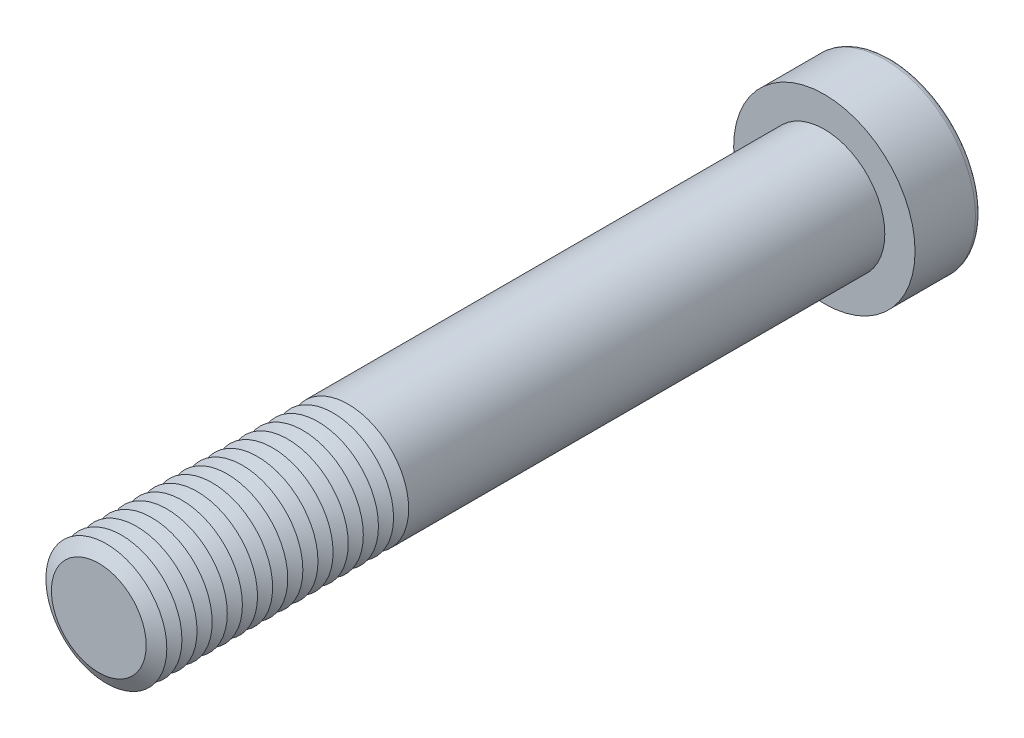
ISO-10303-21;
HEADER;
FILE_DESCRIPTION(('STEP AP214'),'2;1');
FILE_NAME('part.step','',(''),(''),'','','');
FILE_SCHEMA(('AUTOMOTIVE_DESIGN { 1 0 10303 214 1 1 1 1 }'));
ENDSEC;
DATA;
#1=APPLICATION_CONTEXT('core data for automotive mechanical design processes');
#2=APPLICATION_PROTOCOL_DEFINITION('international standard','automotive_design',2000,#1);
#3=PRODUCT_CONTEXT('',#1,'mechanical');
#4=PRODUCT('Part','Part','',(#3));
#5=PRODUCT_RELATED_PRODUCT_CATEGORY('part','',(#4));
#6=PRODUCT_DEFINITION_FORMATION('','',#4);
#7=PRODUCT_DEFINITION_CONTEXT('part definition',#1,'design');
#8=PRODUCT_DEFINITION('design','',#6,#7);
#9=PRODUCT_DEFINITION_SHAPE('','',#8);
#10=(LENGTH_UNIT() NAMED_UNIT(*) SI_UNIT(.MILLI.,.METRE.));
#11=(NAMED_UNIT(*) PLANE_ANGLE_UNIT() SI_UNIT($,.RADIAN.));
#12=(NAMED_UNIT(*) SI_UNIT($,.STERADIAN.) SOLID_ANGLE_UNIT());
#13=UNCERTAINTY_MEASURE_WITH_UNIT(LENGTH_MEASURE(1.E-05),#10,'distance_accuracy_value','');
#14=(GEOMETRIC_REPRESENTATION_CONTEXT(3) GLOBAL_UNCERTAINTY_ASSIGNED_CONTEXT((#13)) GLOBAL_UNIT_ASSIGNED_CONTEXT((#10,
#11,#12)) REPRESENTATION_CONTEXT('',''));
#15=CARTESIAN_POINT('',(0.,0.,0.));
#16=DIRECTION('',(0.,0.,1.));
#17=DIRECTION('',(1.,0.,0.));
#18=AXIS2_PLACEMENT_3D('',#15,#16,#17);
#19=CARTESIAN_POINT('',(0.,0.,111.25));
#20=DIRECTION('',(0.,0.,1.));
#21=DIRECTION('',(1.,0.,0.));
#22=AXIS2_PLACEMENT_3D('',#19,#20,#21);
#23=CONICAL_SURFACE('',#22,10.,1.0471975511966);
#24=CARTESIAN_POINT('',(0.,0.,110.));
#25=DIRECTION('',(0.,0.,1.));
#26=DIRECTION('',(1.,0.,0.));
#27=AXIS2_PLACEMENT_3D('',#24,#25,#26);
#28=CIRCLE('',#27,7.8349364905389);
#29=CARTESIAN_POINT('',(7.8349364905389,0.,110.));
#30=VERTEX_POINT('',#29);
#31=EDGE_CURVE('E313',#30,#30,#28,.T.);
#32=ORIENTED_EDGE('',*,*,#31,.T.);
#33=EDGE_LOOP('',(#32));
#34=FACE_BOUND('',#33,.T.);
#35=CARTESIAN_POINT('',(0.,0.,111.25));
#36=DIRECTION('',(0.,0.,1.));
#37=DIRECTION('',(1.,0.,0.));
#38=AXIS2_PLACEMENT_3D('',#35,#36,#37);
#39=CIRCLE('',#38,10.);
#40=CARTESIAN_POINT('',(10.,0.,111.25));
#41=VERTEX_POINT('',#40);
#42=EDGE_CURVE('E316',#41,#41,#39,.T.);
#43=ORIENTED_EDGE('',*,*,#42,.F.);
#44=EDGE_LOOP('',(#43));
#45=FACE_BOUND('',#44,.T.);
#46=ADVANCED_FACE('F39',(#34,#45),#23,.T.);
#47=CARTESIAN_POINT('',(0.,0.,110.));
#48=DIRECTION('',(0.,0.,-1.));
#49=DIRECTION('',(-1.,0.,0.));
#50=AXIS2_PLACEMENT_3D('',#47,#48,#49);
#51=CONICAL_SURFACE('',#50,7.8349364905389,1.0471975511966);
#52=CARTESIAN_POINT('',(0.,0.,108.75));
#53=DIRECTION('',(0.,0.,1.));
#54=DIRECTION('',(1.,0.,0.));
#55=AXIS2_PLACEMENT_3D('',#52,#53,#54);
#56=CIRCLE('',#55,10.);
#57=CARTESIAN_POINT('',(10.,0.,108.75));
#58=VERTEX_POINT('',#57);
#59=EDGE_CURVE('E324',#58,#58,#56,.T.);
#60=ORIENTED_EDGE('',*,*,#59,.T.);
#61=EDGE_LOOP('',(#60));
#62=FACE_BOUND('',#61,.T.);
#63=ORIENTED_EDGE('',*,*,#31,.F.);
#64=EDGE_LOOP('',(#63));
#65=FACE_BOUND('',#64,.T.);
#66=ADVANCED_FACE('F244',(#62,#65),#51,.T.);
#67=CARTESIAN_POINT('',(0.,0.,120.));
#68=DIRECTION('',(0.,0.,1.));
#69=DIRECTION('',(1.,0.,0.));
#70=AXIS2_PLACEMENT_3D('',#67,#68,#69);
#71=PLANE('',#70);
#72=CARTESIAN_POINT('',(0.,0.,120.));
#73=DIRECTION('',(0.,0.,1.));
#74=DIRECTION('',(1.,0.,0.));
#75=AXIS2_PLACEMENT_3D('',#72,#73,#74);
#76=CIRCLE('',#75,7.8349364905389);
#77=CARTESIAN_POINT('',(7.8349364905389,0.,120.));
#78=VERTEX_POINT('',#77);
#79=EDGE_CURVE('E174',#78,#78,#76,.T.);
#80=ORIENTED_EDGE('',*,*,#79,.T.);
#81=EDGE_LOOP('',(#80));
#82=FACE_BOUND('',#81,.T.);
#83=ADVANCED_FACE('F250',(#82),#71,.T.);
#84=CARTESIAN_POINT('',(0.,0.,120.));
#85=DIRECTION('',(0.,0.,-1.));
#86=DIRECTION('',(-1.,0.,0.));
#87=AXIS2_PLACEMENT_3D('',#84,#85,#86);
#88=CONICAL_SURFACE('',#87,7.8349364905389,1.0471975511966);
#89=CARTESIAN_POINT('',(0.,0.,118.75));
#90=DIRECTION('',(0.,0.,1.));
#91=DIRECTION('',(1.,0.,0.));
#92=AXIS2_PLACEMENT_3D('',#89,#90,#91);
#93=CIRCLE('',#92,10.);
#94=CARTESIAN_POINT('',(10.,0.,118.75));
#95=VERTEX_POINT('',#94);
#96=EDGE_CURVE('E290',#95,#95,#93,.T.);
#97=ORIENTED_EDGE('',*,*,#96,.T.);
#98=EDGE_LOOP('',(#97));
#99=FACE_BOUND('',#98,.T.);
#100=ORIENTED_EDGE('',*,*,#79,.F.);
#101=EDGE_LOOP('',(#100));
#102=FACE_BOUND('',#101,.T.);
#103=ADVANCED_FACE('F198',(#99,#102),#88,.T.);
#104=CARTESIAN_POINT('',(0.,0.,118.75));
#105=DIRECTION('',(0.,0.,1.));
#106=DIRECTION('',(1.,0.,0.));
#107=AXIS2_PLACEMENT_3D('',#104,#105,#106);
#108=CONICAL_SURFACE('',#107,10.,1.0471975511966);
#109=CARTESIAN_POINT('',(0.,0.,117.5));
#110=DIRECTION('',(0.,0.,1.));
#111=DIRECTION('',(1.,0.,0.));
#112=AXIS2_PLACEMENT_3D('',#109,#110,#111);
#113=CIRCLE('',#112,7.8349364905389);
#114=CARTESIAN_POINT('',(7.8349364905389,0.,117.5));
#115=VERTEX_POINT('',#114);
#116=EDGE_CURVE('E287',#115,#115,#113,.T.);
#117=ORIENTED_EDGE('',*,*,#116,.T.);
#118=EDGE_LOOP('',(#117));
#119=FACE_BOUND('',#118,.T.);
#120=ORIENTED_EDGE('',*,*,#96,.F.);
#121=EDGE_LOOP('',(#120));
#122=FACE_BOUND('',#121,.T.);
#123=ADVANCED_FACE('F276',(#119,#122),#108,.T.);
#124=CARTESIAN_POINT('',(0.,0.,117.5));
#125=DIRECTION('',(0.,0.,-1.));
#126=DIRECTION('',(-1.,0.,0.));
#127=AXIS2_PLACEMENT_3D('',#124,#125,#126);
#128=CONICAL_SURFACE('',#127,7.8349364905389,1.0471975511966);
#129=CARTESIAN_POINT('',(0.,0.,116.25));
#130=DIRECTION('',(0.,0.,1.));
#131=DIRECTION('',(1.,0.,0.));
#132=AXIS2_PLACEMENT_3D('',#129,#130,#131);
#133=CIRCLE('',#132,10.);
#134=CARTESIAN_POINT('',(10.,0.,116.25));
#135=VERTEX_POINT('',#134);
#136=EDGE_CURVE('E299',#135,#135,#133,.T.);
#137=ORIENTED_EDGE('',*,*,#136,.T.);
#138=EDGE_LOOP('',(#137));
#139=FACE_BOUND('',#138,.T.);
#140=ORIENTED_EDGE('',*,*,#116,.F.);
#141=EDGE_LOOP('',(#140));
#142=FACE_BOUND('',#141,.T.);
#143=ADVANCED_FACE('F273',(#139,#142),#128,.T.);
#144=CARTESIAN_POINT('',(0.,0.,116.25));
#145=DIRECTION('',(0.,0.,1.));
#146=DIRECTION('',(1.,0.,0.));
#147=AXIS2_PLACEMENT_3D('',#144,#145,#146);
#148=CONICAL_SURFACE('',#147,10.,1.0471975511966);
#149=CARTESIAN_POINT('',(0.,0.,115.));
#150=DIRECTION('',(0.,0.,1.));
#151=DIRECTION('',(1.,0.,0.));
#152=AXIS2_PLACEMENT_3D('',#149,#150,#151);
#153=CIRCLE('',#152,7.8349364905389);
#154=CARTESIAN_POINT('',(7.8349364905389,0.,115.));
#155=VERTEX_POINT('',#154);
#156=EDGE_CURVE('E292',#155,#155,#153,.T.);
#157=ORIENTED_EDGE('',*,*,#156,.T.);
#158=EDGE_LOOP('',(#157));
#159=FACE_BOUND('',#158,.T.);
#160=ORIENTED_EDGE('',*,*,#136,.F.);
#161=EDGE_LOOP('',(#160));
#162=FACE_BOUND('',#161,.T.);
#163=ADVANCED_FACE('F269',(#159,#162),#148,.T.);
#164=CARTESIAN_POINT('',(0.,0.,115.));
#165=DIRECTION('',(0.,0.,-1.));
#166=DIRECTION('',(-1.,0.,0.));
#167=AXIS2_PLACEMENT_3D('',#164,#165,#166);
#168=CONICAL_SURFACE('',#167,7.8349364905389,1.0471975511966);
#169=CARTESIAN_POINT('',(0.,0.,113.75));
#170=DIRECTION('',(0.,0.,1.));
#171=DIRECTION('',(1.,0.,0.));
#172=AXIS2_PLACEMENT_3D('',#169,#170,#171);
#173=CIRCLE('',#172,10.);
#174=CARTESIAN_POINT('',(10.,0.,113.75));
#175=VERTEX_POINT('',#174);
#176=EDGE_CURVE('E309',#175,#175,#173,.T.);
#177=ORIENTED_EDGE('',*,*,#176,.T.);
#178=EDGE_LOOP('',(#177));
#179=FACE_BOUND('',#178,.T.);
#180=ORIENTED_EDGE('',*,*,#156,.F.);
#181=EDGE_LOOP('',(#180));
#182=FACE_BOUND('',#181,.T.);
#183=ADVANCED_FACE('F265',(#179,#182),#168,.T.);
#184=CARTESIAN_POINT('',(0.,0.,113.75));
#185=DIRECTION('',(0.,0.,1.));
#186=DIRECTION('',(1.,0.,0.));
#187=AXIS2_PLACEMENT_3D('',#184,#185,#186);
#188=CONICAL_SURFACE('',#187,10.,1.0471975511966);
#189=CARTESIAN_POINT('',(0.,0.,112.5));
#190=DIRECTION('',(0.,0.,1.));
#191=DIRECTION('',(1.,0.,0.));
#192=AXIS2_PLACEMENT_3D('',#189,#190,#191);
#193=CIRCLE('',#192,7.8349364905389);
#194=CARTESIAN_POINT('',(7.8349364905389,0.,112.5));
#195=VERTEX_POINT('',#194);
#196=EDGE_CURVE('E305',#195,#195,#193,.T.);
#197=ORIENTED_EDGE('',*,*,#196,.T.);
#198=EDGE_LOOP('',(#197));
#199=FACE_BOUND('',#198,.T.);
#200=ORIENTED_EDGE('',*,*,#176,.F.);
#201=EDGE_LOOP('',(#200));
#202=FACE_BOUND('',#201,.T.);
#203=ADVANCED_FACE('F261',(#199,#202),#188,.T.);
#204=CARTESIAN_POINT('',(0.,0.,112.5));
#205=DIRECTION('',(0.,0.,-1.));
#206=DIRECTION('',(-1.,0.,0.));
#207=AXIS2_PLACEMENT_3D('',#204,#205,#206);
#208=CONICAL_SURFACE('',#207,7.8349364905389,1.0471975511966);
#209=ORIENTED_EDGE('',*,*,#42,.T.);
#210=EDGE_LOOP('',(#209));
#211=FACE_BOUND('',#210,.T.);
#212=ORIENTED_EDGE('',*,*,#196,.F.);
#213=EDGE_LOOP('',(#212));
#214=FACE_BOUND('',#213,.T.);
#215=ADVANCED_FACE('F257',(#211,#214),#208,.T.);
#216=CARTESIAN_POINT('',(0.,0.,108.75));
#217=DIRECTION('',(0.,0.,1.));
#218=DIRECTION('',(1.,0.,0.));
#219=AXIS2_PLACEMENT_3D('',#216,#217,#218);
#220=CONICAL_SURFACE('',#219,10.,1.0471975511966);
#221=CARTESIAN_POINT('',(0.,0.,107.5));
#222=DIRECTION('',(0.,0.,1.));
#223=DIRECTION('',(1.,0.,0.));
#224=AXIS2_PLACEMENT_3D('',#221,#222,#223);
#225=CIRCLE('',#224,7.8349364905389);
#226=CARTESIAN_POINT('',(7.8349364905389,0.,107.5));
#227=VERTEX_POINT('',#226);
#228=EDGE_CURVE('E320',#227,#227,#225,.T.);
#229=ORIENTED_EDGE('',*,*,#228,.T.);
#230=EDGE_LOOP('',(#229));
#231=FACE_BOUND('',#230,.T.);
#232=ORIENTED_EDGE('',*,*,#59,.F.);
#233=EDGE_LOOP('',(#232));
#234=FACE_BOUND('',#233,.T.);
#235=ADVANCED_FACE('F260',(#231,#234),#220,.T.);
#236=CARTESIAN_POINT('',(0.,0.,107.5));
#237=DIRECTION('',(0.,0.,-1.));
#238=DIRECTION('',(-1.,0.,0.));
#239=AXIS2_PLACEMENT_3D('',#236,#237,#238);
#240=CONICAL_SURFACE('',#239,7.8349364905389,1.0471975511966);
#241=CARTESIAN_POINT('',(0.,0.,106.25));
#242=DIRECTION('',(0.,0.,1.));
#243=DIRECTION('',(1.,0.,0.));
#244=AXIS2_PLACEMENT_3D('',#241,#242,#243);
#245=CIRCLE('',#244,10.);
#246=CARTESIAN_POINT('',(10.,0.,106.25));
#247=VERTEX_POINT('',#246);
#248=EDGE_CURVE('E332',#247,#247,#245,.T.);
#249=ORIENTED_EDGE('',*,*,#248,.T.);
#250=EDGE_LOOP('',(#249));
#251=FACE_BOUND('',#250,.T.);
#252=ORIENTED_EDGE('',*,*,#228,.F.);
#253=EDGE_LOOP('',(#252));
#254=FACE_BOUND('',#253,.T.);
#255=ADVANCED_FACE('F512',(#251,#254),#240,.T.);
#256=CARTESIAN_POINT('',(0.,0.,106.25));
#257=DIRECTION('',(0.,0.,1.));
#258=DIRECTION('',(1.,0.,0.));
#259=AXIS2_PLACEMENT_3D('',#256,#257,#258);
#260=CONICAL_SURFACE('',#259,10.,1.0471975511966);
#261=CARTESIAN_POINT('',(0.,0.,105.));
#262=DIRECTION('',(0.,0.,1.));
#263=DIRECTION('',(1.,0.,0.));
#264=AXIS2_PLACEMENT_3D('',#261,#262,#263);
#265=CIRCLE('',#264,7.8349364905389);
#266=CARTESIAN_POINT('',(7.8349364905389,0.,105.));
#267=VERTEX_POINT('',#266);
#268=EDGE_CURVE('E328',#267,#267,#265,.T.);
#269=ORIENTED_EDGE('',*,*,#268,.T.);
#270=EDGE_LOOP('',(#269));
#271=FACE_BOUND('',#270,.T.);
#272=ORIENTED_EDGE('',*,*,#248,.F.);
#273=EDGE_LOOP('',(#272));
#274=FACE_BOUND('',#273,.T.);
#275=ADVANCED_FACE('F508',(#271,#274),#260,.T.);
#276=CARTESIAN_POINT('',(0.,0.,105.));
#277=DIRECTION('',(0.,0.,-1.));
#278=DIRECTION('',(-1.,0.,0.));
#279=AXIS2_PLACEMENT_3D('',#276,#277,#278);
#280=CONICAL_SURFACE('',#279,7.8349364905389,1.0471975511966);
#281=CARTESIAN_POINT('',(0.,0.,103.75));
#282=DIRECTION('',(0.,0.,1.));
#283=DIRECTION('',(1.,0.,0.));
#284=AXIS2_PLACEMENT_3D('',#281,#282,#283);
#285=CIRCLE('',#284,10.);
#286=CARTESIAN_POINT('',(10.,0.,103.75));
#287=VERTEX_POINT('',#286);
#288=EDGE_CURVE('E340',#287,#287,#285,.T.);
#289=ORIENTED_EDGE('',*,*,#288,.T.);
#290=EDGE_LOOP('',(#289));
#291=FACE_BOUND('',#290,.T.);
#292=ORIENTED_EDGE('',*,*,#268,.F.);
#293=EDGE_LOOP('',(#292));
#294=FACE_BOUND('',#293,.T.);
#295=ADVANCED_FACE('F504',(#291,#294),#280,.T.);
#296=CARTESIAN_POINT('',(0.,0.,103.75));
#297=DIRECTION('',(0.,0.,1.));
#298=DIRECTION('',(1.,0.,0.));
#299=AXIS2_PLACEMENT_3D('',#296,#297,#298);
#300=CONICAL_SURFACE('',#299,10.,1.0471975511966);
#301=CARTESIAN_POINT('',(0.,0.,102.5));
#302=DIRECTION('',(0.,0.,1.));
#303=DIRECTION('',(1.,0.,0.));
#304=AXIS2_PLACEMENT_3D('',#301,#302,#303);
#305=CIRCLE('',#304,7.8349364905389);
#306=CARTESIAN_POINT('',(7.8349364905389,0.,102.5));
#307=VERTEX_POINT('',#306);
#308=EDGE_CURVE('E336',#307,#307,#305,.T.);
#309=ORIENTED_EDGE('',*,*,#308,.T.);
#310=EDGE_LOOP('',(#309));
#311=FACE_BOUND('',#310,.T.);
#312=ORIENTED_EDGE('',*,*,#288,.F.);
#313=EDGE_LOOP('',(#312));
#314=FACE_BOUND('',#313,.T.);
#315=ADVANCED_FACE('F500',(#311,#314),#300,.T.);
#316=CARTESIAN_POINT('',(0.,0.,102.5));
#317=DIRECTION('',(0.,0.,-1.));
#318=DIRECTION('',(-1.,0.,0.));
#319=AXIS2_PLACEMENT_3D('',#316,#317,#318);
#320=CONICAL_SURFACE('',#319,7.8349364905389,1.0471975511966);
#321=CARTESIAN_POINT('',(0.,0.,101.25));
#322=DIRECTION('',(0.,0.,1.));
#323=DIRECTION('',(1.,0.,0.));
#324=AXIS2_PLACEMENT_3D('',#321,#322,#323);
#325=CIRCLE('',#324,10.);
#326=CARTESIAN_POINT('',(10.,0.,101.25));
#327=VERTEX_POINT('',#326);
#328=EDGE_CURVE('E348',#327,#327,#325,.T.);
#329=ORIENTED_EDGE('',*,*,#328,.T.);
#330=EDGE_LOOP('',(#329));
#331=FACE_BOUND('',#330,.T.);
#332=ORIENTED_EDGE('',*,*,#308,.F.);
#333=EDGE_LOOP('',(#332));
#334=FACE_BOUND('',#333,.T.);
#335=ADVANCED_FACE('F496',(#331,#334),#320,.T.);
#336=CARTESIAN_POINT('',(0.,0.,101.25));
#337=DIRECTION('',(0.,0.,1.));
#338=DIRECTION('',(1.,0.,0.));
#339=AXIS2_PLACEMENT_3D('',#336,#337,#338);
#340=CONICAL_SURFACE('',#339,10.,1.0471975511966);
#341=CARTESIAN_POINT('',(0.,0.,100.));
#342=DIRECTION('',(0.,0.,1.));
#343=DIRECTION('',(1.,0.,0.));
#344=AXIS2_PLACEMENT_3D('',#341,#342,#343);
#345=CIRCLE('',#344,7.8349364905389);
#346=CARTESIAN_POINT('',(7.8349364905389,0.,100.));
#347=VERTEX_POINT('',#346);
#348=EDGE_CURVE('E344',#347,#347,#345,.T.);
#349=ORIENTED_EDGE('',*,*,#348,.T.);
#350=EDGE_LOOP('',(#349));
#351=FACE_BOUND('',#350,.T.);
#352=ORIENTED_EDGE('',*,*,#328,.F.);
#353=EDGE_LOOP('',(#352));
#354=FACE_BOUND('',#353,.T.);
#355=ADVANCED_FACE('F492',(#351,#354),#340,.T.);
#356=CARTESIAN_POINT('',(0.,0.,100.));
#357=DIRECTION('',(0.,0.,-1.));
#358=DIRECTION('',(-1.,0.,0.));
#359=AXIS2_PLACEMENT_3D('',#356,#357,#358);
#360=CONICAL_SURFACE('',#359,7.8349364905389,1.0471975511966);
#361=CARTESIAN_POINT('',(0.,0.,98.75));
#362=DIRECTION('',(0.,0.,1.));
#363=DIRECTION('',(1.,0.,0.));
#364=AXIS2_PLACEMENT_3D('',#361,#362,#363);
#365=CIRCLE('',#364,10.);
#366=CARTESIAN_POINT('',(10.,0.,98.75));
#367=VERTEX_POINT('',#366);
#368=EDGE_CURVE('E356',#367,#367,#365,.T.);
#369=ORIENTED_EDGE('',*,*,#368,.T.);
#370=EDGE_LOOP('',(#369));
#371=FACE_BOUND('',#370,.T.);
#372=ORIENTED_EDGE('',*,*,#348,.F.);
#373=EDGE_LOOP('',(#372));
#374=FACE_BOUND('',#373,.T.);
#375=ADVANCED_FACE('F488',(#371,#374),#360,.T.);
#376=CARTESIAN_POINT('',(0.,0.,98.75));
#377=DIRECTION('',(0.,0.,1.));
#378=DIRECTION('',(1.,0.,0.));
#379=AXIS2_PLACEMENT_3D('',#376,#377,#378);
#380=CONICAL_SURFACE('',#379,10.,1.0471975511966);
#381=CARTESIAN_POINT('',(0.,0.,97.5));
#382=DIRECTION('',(0.,0.,1.));
#383=DIRECTION('',(1.,0.,0.));
#384=AXIS2_PLACEMENT_3D('',#381,#382,#383);
#385=CIRCLE('',#384,7.8349364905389);
#386=CARTESIAN_POINT('',(7.8349364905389,0.,97.5));
#387=VERTEX_POINT('',#386);
#388=EDGE_CURVE('E352',#387,#387,#385,.T.);
#389=ORIENTED_EDGE('',*,*,#388,.T.);
#390=EDGE_LOOP('',(#389));
#391=FACE_BOUND('',#390,.T.);
#392=ORIENTED_EDGE('',*,*,#368,.F.);
#393=EDGE_LOOP('',(#392));
#394=FACE_BOUND('',#393,.T.);
#395=ADVANCED_FACE('F484',(#391,#394),#380,.T.);
#396=CARTESIAN_POINT('',(0.,0.,97.5));
#397=DIRECTION('',(0.,0.,-1.));
#398=DIRECTION('',(-1.,0.,0.));
#399=AXIS2_PLACEMENT_3D('',#396,#397,#398);
#400=CONICAL_SURFACE('',#399,7.8349364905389,1.0471975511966);
#401=CARTESIAN_POINT('',(0.,0.,96.25));
#402=DIRECTION('',(0.,0.,1.));
#403=DIRECTION('',(1.,0.,0.));
#404=AXIS2_PLACEMENT_3D('',#401,#402,#403);
#405=CIRCLE('',#404,10.);
#406=CARTESIAN_POINT('',(10.,0.,96.25));
#407=VERTEX_POINT('',#406);
#408=EDGE_CURVE('E364',#407,#407,#405,.T.);
#409=ORIENTED_EDGE('',*,*,#408,.T.);
#410=EDGE_LOOP('',(#409));
#411=FACE_BOUND('',#410,.T.);
#412=ORIENTED_EDGE('',*,*,#388,.F.);
#413=EDGE_LOOP('',(#412));
#414=FACE_BOUND('',#413,.T.);
#415=ADVANCED_FACE('F480',(#411,#414),#400,.T.);
#416=CARTESIAN_POINT('',(0.,0.,96.25));
#417=DIRECTION('',(0.,0.,1.));
#418=DIRECTION('',(1.,0.,0.));
#419=AXIS2_PLACEMENT_3D('',#416,#417,#418);
#420=CONICAL_SURFACE('',#419,10.,1.0471975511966);
#421=CARTESIAN_POINT('',(0.,0.,95.));
#422=DIRECTION('',(0.,0.,1.));
#423=DIRECTION('',(1.,0.,0.));
#424=AXIS2_PLACEMENT_3D('',#421,#422,#423);
#425=CIRCLE('',#424,7.8349364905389);
#426=CARTESIAN_POINT('',(7.8349364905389,0.,95.));
#427=VERTEX_POINT('',#426);
#428=EDGE_CURVE('E360',#427,#427,#425,.T.);
#429=ORIENTED_EDGE('',*,*,#428,.T.);
#430=EDGE_LOOP('',(#429));
#431=FACE_BOUND('',#430,.T.);
#432=ORIENTED_EDGE('',*,*,#408,.F.);
#433=EDGE_LOOP('',(#432));
#434=FACE_BOUND('',#433,.T.);
#435=ADVANCED_FACE('F476',(#431,#434),#420,.T.);
#436=CARTESIAN_POINT('',(0.,0.,95.));
#437=DIRECTION('',(0.,0.,-1.));
#438=DIRECTION('',(-1.,0.,0.));
#439=AXIS2_PLACEMENT_3D('',#436,#437,#438);
#440=CONICAL_SURFACE('',#439,7.8349364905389,1.0471975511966);
#441=CARTESIAN_POINT('',(0.,0.,93.75));
#442=DIRECTION('',(0.,0.,1.));
#443=DIRECTION('',(1.,0.,0.));
#444=AXIS2_PLACEMENT_3D('',#441,#442,#443);
#445=CIRCLE('',#444,10.);
#446=CARTESIAN_POINT('',(10.,0.,93.75));
#447=VERTEX_POINT('',#446);
#448=EDGE_CURVE('E372',#447,#447,#445,.T.);
#449=ORIENTED_EDGE('',*,*,#448,.T.);
#450=EDGE_LOOP('',(#449));
#451=FACE_BOUND('',#450,.T.);
#452=ORIENTED_EDGE('',*,*,#428,.F.);
#453=EDGE_LOOP('',(#452));
#454=FACE_BOUND('',#453,.T.);
#455=ADVANCED_FACE('F472',(#451,#454),#440,.T.);
#456=CARTESIAN_POINT('',(0.,0.,93.75));
#457=DIRECTION('',(0.,0.,1.));
#458=DIRECTION('',(1.,0.,0.));
#459=AXIS2_PLACEMENT_3D('',#456,#457,#458);
#460=CONICAL_SURFACE('',#459,10.,1.0471975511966);
#461=CARTESIAN_POINT('',(0.,0.,92.5));
#462=DIRECTION('',(0.,0.,1.));
#463=DIRECTION('',(1.,0.,0.));
#464=AXIS2_PLACEMENT_3D('',#461,#462,#463);
#465=CIRCLE('',#464,7.8349364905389);
#466=CARTESIAN_POINT('',(7.8349364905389,0.,92.5));
#467=VERTEX_POINT('',#466);
#468=EDGE_CURVE('E368',#467,#467,#465,.T.);
#469=ORIENTED_EDGE('',*,*,#468,.T.);
#470=EDGE_LOOP('',(#469));
#471=FACE_BOUND('',#470,.T.);
#472=ORIENTED_EDGE('',*,*,#448,.F.);
#473=EDGE_LOOP('',(#472));
#474=FACE_BOUND('',#473,.T.);
#475=ADVANCED_FACE('F468',(#471,#474),#460,.T.);
#476=CARTESIAN_POINT('',(0.,0.,92.5));
#477=DIRECTION('',(0.,0.,-1.));
#478=DIRECTION('',(-1.,0.,0.));
#479=AXIS2_PLACEMENT_3D('',#476,#477,#478);
#480=CONICAL_SURFACE('',#479,7.8349364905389,1.0471975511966);
#481=CARTESIAN_POINT('',(0.,0.,91.25));
#482=DIRECTION('',(0.,0.,1.));
#483=DIRECTION('',(1.,0.,0.));
#484=AXIS2_PLACEMENT_3D('',#481,#482,#483);
#485=CIRCLE('',#484,10.);
#486=CARTESIAN_POINT('',(10.,0.,91.25));
#487=VERTEX_POINT('',#486);
#488=EDGE_CURVE('E380',#487,#487,#485,.T.);
#489=ORIENTED_EDGE('',*,*,#488,.T.);
#490=EDGE_LOOP('',(#489));
#491=FACE_BOUND('',#490,.T.);
#492=ORIENTED_EDGE('',*,*,#468,.F.);
#493=EDGE_LOOP('',(#492));
#494=FACE_BOUND('',#493,.T.);
#495=ADVANCED_FACE('F464',(#491,#494),#480,.T.);
#496=CARTESIAN_POINT('',(0.,0.,91.25));
#497=DIRECTION('',(0.,0.,1.));
#498=DIRECTION('',(1.,0.,0.));
#499=AXIS2_PLACEMENT_3D('',#496,#497,#498);
#500=CONICAL_SURFACE('',#499,10.,1.0471975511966);
#501=CARTESIAN_POINT('',(0.,0.,90.));
#502=DIRECTION('',(0.,0.,1.));
#503=DIRECTION('',(1.,0.,0.));
#504=AXIS2_PLACEMENT_3D('',#501,#502,#503);
#505=CIRCLE('',#504,7.8349364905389);
#506=CARTESIAN_POINT('',(7.8349364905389,0.,90.));
#507=VERTEX_POINT('',#506);
#508=EDGE_CURVE('E376',#507,#507,#505,.T.);
#509=ORIENTED_EDGE('',*,*,#508,.T.);
#510=EDGE_LOOP('',(#509));
#511=FACE_BOUND('',#510,.T.);
#512=ORIENTED_EDGE('',*,*,#488,.F.);
#513=EDGE_LOOP('',(#512));
#514=FACE_BOUND('',#513,.T.);
#515=ADVANCED_FACE('F460',(#511,#514),#500,.T.);
#516=CARTESIAN_POINT('',(0.,0.,90.));
#517=DIRECTION('',(0.,0.,-1.));
#518=DIRECTION('',(-1.,0.,0.));
#519=AXIS2_PLACEMENT_3D('',#516,#517,#518);
#520=CONICAL_SURFACE('',#519,7.8349364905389,1.0471975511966);
#521=CARTESIAN_POINT('',(0.,0.,88.75));
#522=DIRECTION('',(0.,0.,1.));
#523=DIRECTION('',(1.,0.,0.));
#524=AXIS2_PLACEMENT_3D('',#521,#522,#523);
#525=CIRCLE('',#524,10.);
#526=CARTESIAN_POINT('',(10.,0.,88.75));
#527=VERTEX_POINT('',#526);
#528=EDGE_CURVE('E388',#527,#527,#525,.T.);
#529=ORIENTED_EDGE('',*,*,#528,.T.);
#530=EDGE_LOOP('',(#529));
#531=FACE_BOUND('',#530,.T.);
#532=ORIENTED_EDGE('',*,*,#508,.F.);
#533=EDGE_LOOP('',(#532));
#534=FACE_BOUND('',#533,.T.);
#535=ADVANCED_FACE('F456',(#531,#534),#520,.T.);
#536=CARTESIAN_POINT('',(0.,0.,88.75));
#537=DIRECTION('',(0.,0.,1.));
#538=DIRECTION('',(1.,0.,0.));
#539=AXIS2_PLACEMENT_3D('',#536,#537,#538);
#540=CONICAL_SURFACE('',#539,10.,1.0471975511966);
#541=CARTESIAN_POINT('',(0.,0.,87.5));
#542=DIRECTION('',(0.,0.,1.));
#543=DIRECTION('',(1.,0.,0.));
#544=AXIS2_PLACEMENT_3D('',#541,#542,#543);
#545=CIRCLE('',#544,7.8349364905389);
#546=CARTESIAN_POINT('',(7.8349364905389,0.,87.5));
#547=VERTEX_POINT('',#546);
#548=EDGE_CURVE('E384',#547,#547,#545,.T.);
#549=ORIENTED_EDGE('',*,*,#548,.T.);
#550=EDGE_LOOP('',(#549));
#551=FACE_BOUND('',#550,.T.);
#552=ORIENTED_EDGE('',*,*,#528,.F.);
#553=EDGE_LOOP('',(#552));
#554=FACE_BOUND('',#553,.T.);
#555=ADVANCED_FACE('F452',(#551,#554),#540,.T.);
#556=CARTESIAN_POINT('',(0.,0.,87.5));
#557=DIRECTION('',(0.,0.,-1.));
#558=DIRECTION('',(-1.,0.,0.));
#559=AXIS2_PLACEMENT_3D('',#556,#557,#558);
#560=CONICAL_SURFACE('',#559,7.8349364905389,1.0471975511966);
#561=CARTESIAN_POINT('',(0.,0.,86.25));
#562=DIRECTION('',(0.,0.,1.));
#563=DIRECTION('',(1.,0.,0.));
#564=AXIS2_PLACEMENT_3D('',#561,#562,#563);
#565=CIRCLE('',#564,10.);
#566=CARTESIAN_POINT('',(10.,0.,86.25));
#567=VERTEX_POINT('',#566);
#568=EDGE_CURVE('E396',#567,#567,#565,.T.);
#569=ORIENTED_EDGE('',*,*,#568,.T.);
#570=EDGE_LOOP('',(#569));
#571=FACE_BOUND('',#570,.T.);
#572=ORIENTED_EDGE('',*,*,#548,.F.);
#573=EDGE_LOOP('',(#572));
#574=FACE_BOUND('',#573,.T.);
#575=ADVANCED_FACE('F448',(#571,#574),#560,.T.);
#576=CARTESIAN_POINT('',(0.,0.,86.25));
#577=DIRECTION('',(0.,0.,1.));
#578=DIRECTION('',(1.,0.,0.));
#579=AXIS2_PLACEMENT_3D('',#576,#577,#578);
#580=CONICAL_SURFACE('',#579,10.,1.0471975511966);
#581=CARTESIAN_POINT('',(0.,0.,85.));
#582=DIRECTION('',(0.,0.,1.));
#583=DIRECTION('',(1.,0.,0.));
#584=AXIS2_PLACEMENT_3D('',#581,#582,#583);
#585=CIRCLE('',#584,7.8349364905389);
#586=CARTESIAN_POINT('',(7.8349364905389,0.,85.));
#587=VERTEX_POINT('',#586);
#588=EDGE_CURVE('E392',#587,#587,#585,.T.);
#589=ORIENTED_EDGE('',*,*,#588,.T.);
#590=EDGE_LOOP('',(#589));
#591=FACE_BOUND('',#590,.T.);
#592=ORIENTED_EDGE('',*,*,#568,.F.);
#593=EDGE_LOOP('',(#592));
#594=FACE_BOUND('',#593,.T.);
#595=ADVANCED_FACE('F444',(#591,#594),#580,.T.);
#596=CARTESIAN_POINT('',(0.,0.,85.));
#597=DIRECTION('',(0.,0.,-1.));
#598=DIRECTION('',(-1.,0.,0.));
#599=AXIS2_PLACEMENT_3D('',#596,#597,#598);
#600=CONICAL_SURFACE('',#599,7.8349364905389,1.0471975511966);
#601=CARTESIAN_POINT('',(0.,0.,83.75));
#602=DIRECTION('',(0.,0.,1.));
#603=DIRECTION('',(1.,0.,0.));
#604=AXIS2_PLACEMENT_3D('',#601,#602,#603);
#605=CIRCLE('',#604,10.);
#606=CARTESIAN_POINT('',(10.,0.,83.75));
#607=VERTEX_POINT('',#606);
#608=EDGE_CURVE('E404',#607,#607,#605,.T.);
#609=ORIENTED_EDGE('',*,*,#608,.T.);
#610=EDGE_LOOP('',(#609));
#611=FACE_BOUND('',#610,.T.);
#612=ORIENTED_EDGE('',*,*,#588,.F.);
#613=EDGE_LOOP('',(#612));
#614=FACE_BOUND('',#613,.T.);
#615=ADVANCED_FACE('F440',(#611,#614),#600,.T.);
#616=CARTESIAN_POINT('',(0.,0.,83.75));
#617=DIRECTION('',(0.,0.,1.));
#618=DIRECTION('',(1.,0.,0.));
#619=AXIS2_PLACEMENT_3D('',#616,#617,#618);
#620=CONICAL_SURFACE('',#619,10.,1.0471975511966);
#621=CARTESIAN_POINT('',(0.,0.,82.5));
#622=DIRECTION('',(0.,0.,1.));
#623=DIRECTION('',(1.,0.,0.));
#624=AXIS2_PLACEMENT_3D('',#621,#622,#623);
#625=CIRCLE('',#624,7.8349364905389);
#626=CARTESIAN_POINT('',(7.8349364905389,0.,82.5));
#627=VERTEX_POINT('',#626);
#628=EDGE_CURVE('E400',#627,#627,#625,.T.);
#629=ORIENTED_EDGE('',*,*,#628,.T.);
#630=EDGE_LOOP('',(#629));
#631=FACE_BOUND('',#630,.T.);
#632=ORIENTED_EDGE('',*,*,#608,.F.);
#633=EDGE_LOOP('',(#632));
#634=FACE_BOUND('',#633,.T.);
#635=ADVANCED_FACE('F435',(#631,#634),#620,.T.);
#636=CARTESIAN_POINT('',(0.,0.,82.5));
#637=DIRECTION('',(0.,0.,-1.));
#638=DIRECTION('',(-1.,0.,0.));
#639=AXIS2_PLACEMENT_3D('',#636,#637,#638);
#640=CONICAL_SURFACE('',#639,7.8349364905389,1.0471975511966);
#641=CARTESIAN_POINT('',(0.,0.,81.25));
#642=DIRECTION('',(0.,0.,1.));
#643=DIRECTION('',(1.,0.,0.));
#644=AXIS2_PLACEMENT_3D('',#641,#642,#643);
#645=CIRCLE('',#644,10.);
#646=CARTESIAN_POINT('',(10.,0.,81.25));
#647=VERTEX_POINT('',#646);
#648=EDGE_CURVE('E416',#647,#647,#645,.T.);
#649=ORIENTED_EDGE('',*,*,#648,.T.);
#650=EDGE_LOOP('',(#649));
#651=FACE_BOUND('',#650,.T.);
#652=ORIENTED_EDGE('',*,*,#628,.F.);
#653=EDGE_LOOP('',(#652));
#654=FACE_BOUND('',#653,.T.);
#655=ADVANCED_FACE('F421',(#651,#654),#640,.T.);
#656=CARTESIAN_POINT('',(0.,0.,81.25));
#657=DIRECTION('',(0.,0.,1.));
#658=DIRECTION('',(1.,0.,0.));
#659=AXIS2_PLACEMENT_3D('',#656,#657,#658);
#660=CONICAL_SURFACE('',#659,10.,1.0471975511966);
#661=CARTESIAN_POINT('',(0.,0.,80.));
#662=DIRECTION('',(0.,0.,1.));
#663=DIRECTION('',(1.,0.,0.));
#664=AXIS2_PLACEMENT_3D('',#661,#662,#663);
#665=CIRCLE('',#664,7.8349364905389);
#666=CARTESIAN_POINT('',(7.8349364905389,0.,80.));
#667=VERTEX_POINT('',#666);
#668=EDGE_CURVE('E408',#667,#667,#665,.T.);
#669=ORIENTED_EDGE('',*,*,#668,.T.);
#670=EDGE_LOOP('',(#669));
#671=FACE_BOUND('',#670,.T.);
#672=ORIENTED_EDGE('',*,*,#648,.F.);
#673=EDGE_LOOP('',(#672));
#674=FACE_BOUND('',#673,.T.);
#675=ADVANCED_FACE('F424',(#671,#674),#660,.T.);
#676=CARTESIAN_POINT('',(0.,0.,80.));
#677=DIRECTION('',(0.,0.,-1.));
#678=DIRECTION('',(-1.,0.,0.));
#679=AXIS2_PLACEMENT_3D('',#676,#677,#678);
#680=CONICAL_SURFACE('',#679,7.8349364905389,1.0471975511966);
#681=CARTESIAN_POINT('',(0.,0.,78.75));
#682=DIRECTION('',(0.,0.,1.));
#683=DIRECTION('',(1.,0.,0.));
#684=AXIS2_PLACEMENT_3D('',#681,#682,#683);
#685=CIRCLE('',#684,10.);
#686=CARTESIAN_POINT('',(10.,0.,78.75));
#687=VERTEX_POINT('',#686);
#688=EDGE_CURVE('E412',#687,#687,#685,.T.);
#689=ORIENTED_EDGE('',*,*,#688,.T.);
#690=EDGE_LOOP('',(#689));
#691=FACE_BOUND('',#690,.T.);
#692=ORIENTED_EDGE('',*,*,#668,.F.);
#693=EDGE_LOOP('',(#692));
#694=FACE_BOUND('',#693,.T.);
#695=ADVANCED_FACE('F426',(#691,#694),#680,.T.);
#696=CARTESIAN_POINT('',(0.,0.,-0.499999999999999));
#697=DIRECTION('',(0.,0.,-1.));
#698=DIRECTION('',(-1.,0.,0.));
#699=AXIS2_PLACEMENT_3D('',#696,#697,#698);
#700=CONICAL_SURFACE('',#699,7.,1.0471975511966);
#701=CARTESIAN_POINT('',(0.,0.,3.54145188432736));
#702=VERTEX_POINT('',#701);
#703=VERTEX_LOOP('',#702);
#704=FACE_BOUND('',#703,.T.);
#705=CARTESIAN_POINT('',(0.,0.,-0.499999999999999));
#706=DIRECTION('',(0.,0.,-1.));
#707=DIRECTION('',(-1.,0.,0.));
#708=AXIS2_PLACEMENT_3D('',#705,#706,#707);
#709=CIRCLE('',#708,7.);
#710=CARTESIAN_POINT('',(-6.06217782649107,3.5,-0.499999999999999));
#711=VERTEX_POINT('',#710);
#712=CARTESIAN_POINT('',(0.,7.,-0.499999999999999));
#713=VERTEX_POINT('',#712);
#714=EDGE_CURVE('E149',#711,#713,#709,.T.);
#715=ORIENTED_EDGE('',*,*,#714,.T.);
#716=CARTESIAN_POINT('',(0.,0.,-0.499999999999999));
#717=DIRECTION('',(0.,0.,-1.));
#718=DIRECTION('',(-1.,0.,0.));
#719=AXIS2_PLACEMENT_3D('',#716,#717,#718);
#720=CIRCLE('',#719,7.);
#721=CARTESIAN_POINT('',(6.06217782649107,3.5,-0.499999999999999));
#722=VERTEX_POINT('',#721);
#723=EDGE_CURVE('E54',#713,#722,#720,.T.);
#724=ORIENTED_EDGE('',*,*,#723,.T.);
#725=CARTESIAN_POINT('',(6.06217782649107,-3.5,-0.499999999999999));
#726=VERTEX_POINT('',#725);
#727=EDGE_CURVE('E1027',#722,#726,#720,.T.);
#728=ORIENTED_EDGE('',*,*,#727,.T.);
#729=CARTESIAN_POINT('',(0.,-7.,-0.499999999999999));
#730=VERTEX_POINT('',#729);
#731=EDGE_CURVE('E1025',#726,#730,#720,.T.);
#732=ORIENTED_EDGE('',*,*,#731,.T.);
#733=CARTESIAN_POINT('',(-6.06217782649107,-3.5,-0.499999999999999));
#734=VERTEX_POINT('',#733);
#735=EDGE_CURVE('E1019',#730,#734,#720,.T.);
#736=ORIENTED_EDGE('',*,*,#735,.T.);
#737=EDGE_CURVE('E1017',#734,#711,#720,.T.);
#738=ORIENTED_EDGE('',*,*,#737,.T.);
#739=EDGE_LOOP('',(#715,#724,#728,#732,#736,#738));
#740=FACE_BOUND('',#739,.T.);
#741=ADVANCED_FACE('F200',(#704,#740),#700,.F.);
#742=CARTESIAN_POINT('',(0.,0.,-0.499999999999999));
#743=DIRECTION('',(0.,0.,-1.));
#744=DIRECTION('',(-1.,0.,0.));
#745=AXIS2_PLACEMENT_3D('',#742,#743,#744);
#746=PLANE('',#745);
#747=ORIENTED_EDGE('',*,*,#723,.F.);
#748=DIRECTION('',(1.,0.,0.));
#749=VECTOR('',#748,1.);
#750=CARTESIAN_POINT('',(-4.04145188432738,7.,-0.499999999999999));
#751=LINE('',#750,#749);
#752=CARTESIAN_POINT('',(4.04145188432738,7.,-0.499999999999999));
#753=VERTEX_POINT('',#752);
#754=EDGE_CURVE('E1069',#713,#753,#751,.T.);
#755=ORIENTED_EDGE('',*,*,#754,.T.);
#756=DIRECTION('',(0.5,-0.866025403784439,0.));
#757=VECTOR('',#756,1.);
#758=CARTESIAN_POINT('',(4.04145188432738,7.,-0.499999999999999));
#759=LINE('',#758,#757);
#760=EDGE_CURVE('E155',#753,#722,#759,.T.);
#761=ORIENTED_EDGE('',*,*,#760,.T.);
#762=EDGE_LOOP('',(#747,#755,#761));
#763=FACE_BOUND('',#762,.T.);
#764=ADVANCED_FACE('F607',(#763),#746,.T.);
#765=ORIENTED_EDGE('',*,*,#727,.F.);
#766=CARTESIAN_POINT('',(8.08290376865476,0.,-0.499999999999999));
#767=VERTEX_POINT('',#766);
#768=EDGE_CURVE('E1062',#722,#767,#759,.T.);
#769=ORIENTED_EDGE('',*,*,#768,.T.);
#770=DIRECTION('',(-0.5,-0.866025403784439,0.));
#771=VECTOR('',#770,1.);
#772=CARTESIAN_POINT('',(8.08290376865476,0.,-0.499999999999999));
#773=LINE('',#772,#771);
#774=EDGE_CURVE('E1039',#767,#726,#773,.T.);
#775=ORIENTED_EDGE('',*,*,#774,.T.);
#776=EDGE_LOOP('',(#765,#769,#775));
#777=FACE_BOUND('',#776,.T.);
#778=ADVANCED_FACE('F617',(#777),#746,.T.);
#779=ORIENTED_EDGE('',*,*,#731,.F.);
#780=CARTESIAN_POINT('',(4.04145188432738,-7.,-0.499999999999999));
#781=VERTEX_POINT('',#780);
#782=EDGE_CURVE('E1041',#726,#781,#773,.T.);
#783=ORIENTED_EDGE('',*,*,#782,.T.);
#784=DIRECTION('',(-1.,0.,0.));
#785=VECTOR('',#784,1.);
#786=CARTESIAN_POINT('',(4.04145188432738,-7.,-0.499999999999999));
#787=LINE('',#786,#785);
#788=EDGE_CURVE('E993',#781,#730,#787,.T.);
#789=ORIENTED_EDGE('',*,*,#788,.T.);
#790=EDGE_LOOP('',(#779,#783,#789));
#791=FACE_BOUND('',#790,.T.);
#792=ADVANCED_FACE('F627',(#791),#746,.T.);
#793=ORIENTED_EDGE('',*,*,#735,.F.);
#794=CARTESIAN_POINT('',(-4.04145188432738,-7.,-0.499999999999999));
#795=VERTEX_POINT('',#794);
#796=EDGE_CURVE('E1036',#730,#795,#787,.T.);
#797=ORIENTED_EDGE('',*,*,#796,.T.);
#798=DIRECTION('',(-0.5,0.866025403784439,0.));
#799=VECTOR('',#798,1.);
#800=CARTESIAN_POINT('',(-4.04145188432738,-7.,-0.499999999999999));
#801=LINE('',#800,#799);
#802=EDGE_CURVE('E1038',#795,#734,#801,.T.);
#803=ORIENTED_EDGE('',*,*,#802,.T.);
#804=EDGE_LOOP('',(#793,#797,#803));
#805=FACE_BOUND('',#804,.T.);
#806=ADVANCED_FACE('F635',(#805),#746,.T.);
#807=ORIENTED_EDGE('',*,*,#737,.F.);
#808=CARTESIAN_POINT('',(-8.08290376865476,0.,-0.499999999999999));
#809=VERTEX_POINT('',#808);
#810=EDGE_CURVE('E1043',#734,#809,#801,.T.);
#811=ORIENTED_EDGE('',*,*,#810,.T.);
#812=DIRECTION('',(0.5,0.866025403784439,0.));
#813=VECTOR('',#812,1.);
#814=CARTESIAN_POINT('',(-8.08290376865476,0.,-0.499999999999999));
#815=LINE('',#814,#813);
#816=EDGE_CURVE('E158',#809,#711,#815,.T.);
#817=ORIENTED_EDGE('',*,*,#816,.T.);
#818=EDGE_LOOP('',(#807,#811,#817));
#819=FACE_BOUND('',#818,.T.);
#820=ADVANCED_FACE('F230',(#819),#746,.T.);
#821=ORIENTED_EDGE('',*,*,#714,.F.);
#822=CARTESIAN_POINT('',(-4.04145188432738,7.,-0.499999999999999));
#823=VERTEX_POINT('',#822);
#824=EDGE_CURVE('E1050',#711,#823,#815,.T.);
#825=ORIENTED_EDGE('',*,*,#824,.T.);
#826=EDGE_CURVE('E1063',#823,#713,#751,.T.);
#827=ORIENTED_EDGE('',*,*,#826,.T.);
#828=EDGE_LOOP('',(#821,#825,#827));
#829=FACE_BOUND('',#828,.T.);
#830=ADVANCED_FACE('F619',(#829),#746,.T.);
#831=CARTESIAN_POINT('',(-4.04145188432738,7.,-0.499999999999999));
#832=DIRECTION('',(0.,1.,0.));
#833=DIRECTION('',(0.,0.,1.));
#834=AXIS2_PLACEMENT_3D('',#831,#832,#833);
#835=PLANE('',#834);
#836=DIRECTION('',(0.,0.,-1.));
#837=VECTOR('',#836,1.);
#838=CARTESIAN_POINT('',(-4.04145188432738,7.,-0.499999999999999));
#839=LINE('',#838,#837);
#840=CARTESIAN_POINT('',(-4.04145188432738,7.,-11.));
#841=VERTEX_POINT('',#840);
#842=EDGE_CURVE('E147',#823,#841,#839,.T.);
#843=ORIENTED_EDGE('',*,*,#842,.T.);
#844=CARTESIAN_POINT('',(-10.5504265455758,7.,-12.226809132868));
#845=CARTESIAN_POINT('',(-10.234342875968,7.,-12.1562549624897));
#846=CARTESIAN_POINT('',(-9.91805751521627,7.,-12.0865877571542));
#847=CARTESIAN_POINT('',(-9.28498462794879,7.,-11.9495060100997));
#848=CARTESIAN_POINT('',(-8.9681970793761,7.,-11.8820915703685));
#849=CARTESIAN_POINT('',(-8.3337216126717,7.,-11.7499322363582));
#850=CARTESIAN_POINT('',(-8.0160331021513,7.,-11.6851901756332));
#851=CARTESIAN_POINT('',(-7.37998429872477,7.,-11.5590967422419));
#852=CARTESIAN_POINT('',(-7.0616240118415,7.,-11.4977453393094));
#853=CARTESIAN_POINT('',(-6.42688035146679,7.,-11.3797520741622));
#854=CARTESIAN_POINT('',(-6.11050373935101,7.,-11.3230740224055));
#855=CARTESIAN_POINT('',(-5.47688007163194,7.,-11.214821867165));
#856=CARTESIAN_POINT('',(-5.15963303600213,7.,-11.1632476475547));
#857=CARTESIAN_POINT('',(-4.52422055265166,7.,-11.0663930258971));
#858=CARTESIAN_POINT('',(-4.20605525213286,7.,-11.0211116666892));
#859=CARTESIAN_POINT('',(-3.56871761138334,7.,-10.9382023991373));
#860=CARTESIAN_POINT('',(-3.24954527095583,7.,-10.9005744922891));
#861=CARTESIAN_POINT('',(-2.60663136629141,7.,-10.8340645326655));
#862=CARTESIAN_POINT('',(-2.28287891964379,7.,-10.8052860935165));
#863=CARTESIAN_POINT('',(-1.63459129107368,7.,-10.7584808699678));
#864=CARTESIAN_POINT('',(-1.31005612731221,7.,-10.7404538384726));
#865=CARTESIAN_POINT('',(-0.660675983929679,7.,-10.7162037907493));
#866=CARTESIAN_POINT('',(-0.335831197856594,7.,-10.7099756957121));
#867=CARTESIAN_POINT('',(0.313864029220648,7.,-10.7097025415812));
#868=CARTESIAN_POINT('',(0.638714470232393,7.,-10.7156575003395));
#869=CARTESIAN_POINT('',(1.2893045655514,7.,-10.7394217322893));
#870=CARTESIAN_POINT('',(1.61504241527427,7.,-10.7572794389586));
#871=CARTESIAN_POINT('',(2.26573386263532,7.,-10.8038495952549));
#872=CARTESIAN_POINT('',(2.5906874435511,7.,-10.8325622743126));
#873=CARTESIAN_POINT('',(3.23981909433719,7.,-10.8994274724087));
#874=CARTESIAN_POINT('',(3.56399652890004,7.,-10.9375860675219));
#875=CARTESIAN_POINT('',(4.2113121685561,7.,-11.0217977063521));
#876=CARTESIAN_POINT('',(4.53445037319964,7.,-11.0678507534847));
#877=CARTESIAN_POINT('',(5.18817201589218,7.,-11.1677070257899));
#878=CARTESIAN_POINT('',(5.51872906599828,7.,-11.221681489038));
#879=CARTESIAN_POINT('',(6.17890776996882,7.,-11.3351036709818));
#880=CARTESIAN_POINT('',(6.50852939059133,7.,-11.3945515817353));
#881=CARTESIAN_POINT('',(7.16699002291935,7.,-11.5178381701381));
#882=CARTESIAN_POINT('',(7.49582892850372,7.,-11.5816774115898));
#883=CARTESIAN_POINT('',(8.15279770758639,7.,-11.7128718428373));
#884=CARTESIAN_POINT('',(8.48092758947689,7.,-11.7802269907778));
#885=CARTESIAN_POINT('',(9.13669969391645,7.,-11.9177934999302));
#886=CARTESIAN_POINT('',(9.46434171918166,7.,-11.9880057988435));
#887=CARTESIAN_POINT('',(10.1191240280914,7.,-12.1307356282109));
#888=CARTESIAN_POINT('',(10.4462643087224,7.,-12.2032531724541));
#889=CARTESIAN_POINT('',(11.4270001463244,7.,-12.4235988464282));
#890=CARTESIAN_POINT('',(12.079965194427,7.,-12.5742316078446));
#891=CARTESIAN_POINT('',(13.3767589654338,7.,-12.8787334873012));
#892=CARTESIAN_POINT('',(14.0206022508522,7.,-13.0325409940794));
#893=CARTESIAN_POINT('',(15.3074422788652,7.,-13.3437152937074));
#894=CARTESIAN_POINT('',(15.9504390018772,7.,-13.501082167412));
#895=CARTESIAN_POINT('',(17.2348956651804,7.,-13.818185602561));
#896=CARTESIAN_POINT('',(17.8763564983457,7.,-13.9779185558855));
#897=CARTESIAN_POINT('',(19.1587589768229,7.,-14.2993588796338));
#898=CARTESIAN_POINT('',(19.7997006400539,7.,-14.4610661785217));
#899=CARTESIAN_POINT('',(20.4404659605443,7.,-14.6234618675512));
#900=B_SPLINE_CURVE_WITH_KNOTS('',3,(#844,#845,#846,#847,#848,#849,#850,#851,#852,#853,#854,
#855,#856,#857,#858,#859,#860,#861,#862,#863,#864,#865,#866,#867,#868,#869,#870,#871,#872,#873,
#874,#875,#876,#877,#878,#879,#880,#881,#882,#883,#884,#885,#886,#887,#888,#889,#890,#891,#892,
#893,#894,#895,#896,#897,#898,#899),.UNSPECIFIED.,.F.,.F.,(4,2,2,2,2,2,2,2,2,2,2,2,2,2,2,2,2,2,
2,2,2,2,2,2,2,2,2,4),(0.,0.971590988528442,1.94322590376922,2.91586589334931,3.88849719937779,
4.85270391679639,5.81688869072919,6.78092664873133,7.74496479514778,8.71989464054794,
9.69480207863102,10.6692897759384,11.6437789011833,12.6222577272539,13.6007572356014,
14.579887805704,15.5590187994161,16.5637656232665,17.56854771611,18.573459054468,
19.5783584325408,20.583590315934,21.5888282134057,23.59913687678,25.585004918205,
27.5709181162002,29.5540636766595,31.5371375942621),.UNSPECIFIED.);
#901=CARTESIAN_POINT('',(4.04145188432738,7.00000000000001,-11.));
#902=VERTEX_POINT('',#901);
#903=EDGE_CURVE('E124',#841,#902,#900,.T.);
#904=ORIENTED_EDGE('',*,*,#903,.T.);
#905=DIRECTION('',(0.,0.,-1.));
#906=VECTOR('',#905,1.);
#907=CARTESIAN_POINT('',(4.04145188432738,7.,-0.499999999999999));
#908=LINE('',#907,#906);
#909=EDGE_CURVE('E143',#753,#902,#908,.T.);
#910=ORIENTED_EDGE('',*,*,#909,.F.);
#911=ORIENTED_EDGE('',*,*,#754,.F.);
#912=ORIENTED_EDGE('',*,*,#826,.F.);
#913=EDGE_LOOP('',(#843,#904,#910,#911,#912));
#914=FACE_BOUND('',#913,.T.);
#915=ADVANCED_FACE('F141',(#914),#835,.F.);
#916=CARTESIAN_POINT('',(4.04145188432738,7.,-0.499999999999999));
#917=DIRECTION('',(0.866025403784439,0.5,0.));
#918=DIRECTION('',(-0.5,0.866025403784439,0.));
#919=AXIS2_PLACEMENT_3D('',#916,#917,#918);
#920=PLANE('',#919);
#921=ORIENTED_EDGE('',*,*,#909,.T.);
#922=CARTESIAN_POINT('',(4.04133641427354,7.0002,-11.0000309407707));
#923=CARTESIAN_POINT('',(4.20917732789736,6.70949101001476,-10.9550391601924));
#924=CARTESIAN_POINT('',(4.37732255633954,6.41825493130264,-10.9141940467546));
#925=CARTESIAN_POINT('',(4.71420683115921,5.83475425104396,-10.8424330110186));
#926=CARTESIAN_POINT('',(4.88294609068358,5.5424892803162,-10.8115211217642));
#927=CARTESIAN_POINT('',(5.21999536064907,4.95870282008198,-10.7614311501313));
#928=CARTESIAN_POINT('',(5.38830309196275,4.66718527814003,-10.7421933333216));
#929=CARTESIAN_POINT('',(5.72513318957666,4.08377843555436,-10.7163973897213));
#930=CARTESIAN_POINT('',(5.89365550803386,3.79188921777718,-10.7098368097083));
#931=CARTESIAN_POINT('',(6.23070014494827,3.20811078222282,-10.7098368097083));
#932=CARTESIAN_POINT('',(6.39922246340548,2.91622156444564,-10.7163973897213));
#933=CARTESIAN_POINT('',(6.73605256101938,2.33281472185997,-10.7421933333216));
#934=CARTESIAN_POINT('',(6.90436029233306,2.04129717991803,-10.7614311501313));
#935=CARTESIAN_POINT('',(7.24140956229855,1.4575107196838,-10.8115211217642));
#936=CARTESIAN_POINT('',(7.41014882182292,1.16524574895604,-10.8424330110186));
#937=CARTESIAN_POINT('',(7.7470330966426,0.581745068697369,-10.9141940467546));
#938=CARTESIAN_POINT('',(7.91517832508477,0.290508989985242,-10.9550391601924));
#939=CARTESIAN_POINT('',(8.08301923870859,-0.000199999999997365,-11.0000309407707));
#940=B_SPLINE_CURVE_WITH_KNOTS('',3,(#922,#923,#924,#925,#926,#927,#928,#929,#930,#931,#932,
#933,#934,#935,#936,#937,#938,#939),.UNSPECIFIED.,.F.,.F.,(4,2,2,2,2,2,2,2,4),(0.,
1.01610389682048,2.03261982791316,3.04388955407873,4.05496356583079,5.06603757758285,
6.07730730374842,7.0938232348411,8.10992713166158),.UNSPECIFIED.);
#941=CARTESIAN_POINT('',(8.08290376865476,0.,-11.));
#942=VERTEX_POINT('',#941);
#943=EDGE_CURVE('E11',#902,#942,#940,.T.);
#944=ORIENTED_EDGE('',*,*,#943,.T.);
#945=DIRECTION('',(0.,0.,-1.));
#946=VECTOR('',#945,1.);
#947=CARTESIAN_POINT('',(8.08290376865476,0.,-0.499999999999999));
#948=LINE('',#947,#946);
#949=EDGE_CURVE('E157',#767,#942,#948,.T.);
#950=ORIENTED_EDGE('',*,*,#949,.F.);
#951=ORIENTED_EDGE('',*,*,#768,.F.);
#952=ORIENTED_EDGE('',*,*,#760,.F.);
#953=EDGE_LOOP('',(#921,#944,#950,#951,#952));
#954=FACE_BOUND('',#953,.T.);
#955=ADVANCED_FACE('F152',(#954),#920,.F.);
#956=CARTESIAN_POINT('',(8.08290376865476,0.,-0.499999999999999));
#957=DIRECTION('',(0.866025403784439,-0.5,0.));
#958=DIRECTION('',(0.5,0.866025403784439,0.));
#959=AXIS2_PLACEMENT_3D('',#956,#957,#958);
#960=PLANE('',#959);
#961=ORIENTED_EDGE('',*,*,#949,.T.);
#962=CARTESIAN_POINT('',(8.0830192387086,0.000200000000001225,-11.0000309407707));
#963=CARTESIAN_POINT('',(7.91517832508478,-0.290508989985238,-10.9550391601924));
#964=CARTESIAN_POINT('',(7.7470330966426,-0.581745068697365,-10.9141940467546));
#965=CARTESIAN_POINT('',(7.41014882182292,-1.16524574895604,-10.8424330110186));
#966=CARTESIAN_POINT('',(7.24140956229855,-1.4575107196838,-10.8115211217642));
#967=CARTESIAN_POINT('',(6.90436029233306,-2.04129717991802,-10.7614311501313));
#968=CARTESIAN_POINT('',(6.73605256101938,-2.33281472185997,-10.7421933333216));
#969=CARTESIAN_POINT('',(6.39922246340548,-2.91622156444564,-10.7163973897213));
#970=CARTESIAN_POINT('',(6.23070014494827,-3.20811078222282,-10.7098368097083));
#971=CARTESIAN_POINT('',(5.89365550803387,-3.79188921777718,-10.7098368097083));
#972=CARTESIAN_POINT('',(5.72513318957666,-4.08377843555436,-10.7163973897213));
#973=CARTESIAN_POINT('',(5.38830309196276,-4.66718527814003,-10.7421933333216));
#974=CARTESIAN_POINT('',(5.21999536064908,-4.95870282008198,-10.7614311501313));
#975=CARTESIAN_POINT('',(4.88294609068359,-5.5424892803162,-10.8115211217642));
#976=CARTESIAN_POINT('',(4.71420683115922,-5.83475425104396,-10.8424330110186));
#977=CARTESIAN_POINT('',(4.37732255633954,-6.41825493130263,-10.9141940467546));
#978=CARTESIAN_POINT('',(4.20917732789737,-6.70949101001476,-10.9550391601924));
#979=CARTESIAN_POINT('',(4.04133641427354,-7.0002,-11.0000309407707));
#980=B_SPLINE_CURVE_WITH_KNOTS('',3,(#962,#963,#964,#965,#966,#967,#968,#969,#970,#971,#972,
#973,#974,#975,#976,#977,#978,#979),.UNSPECIFIED.,.F.,.F.,(4,2,2,2,2,2,2,2,4),(0.,
1.01610389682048,2.03261982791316,3.04388955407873,4.05496356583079,5.06603757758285,
6.07730730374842,7.0938232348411,8.10992713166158),.UNSPECIFIED.);
#981=CARTESIAN_POINT('',(4.04145188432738,-7.00000000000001,-11.));
#982=VERTEX_POINT('',#981);
#983=EDGE_CURVE('E173',#942,#982,#980,.T.);
#984=ORIENTED_EDGE('',*,*,#983,.T.);
#985=DIRECTION('',(0.,0.,-1.));
#986=VECTOR('',#985,1.);
#987=CARTESIAN_POINT('',(4.04145188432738,-7.,-0.499999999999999));
#988=LINE('',#987,#986);
#989=EDGE_CURVE('E988',#781,#982,#988,.T.);
#990=ORIENTED_EDGE('',*,*,#989,.F.);
#991=ORIENTED_EDGE('',*,*,#782,.F.);
#992=ORIENTED_EDGE('',*,*,#774,.F.);
#993=EDGE_LOOP('',(#961,#984,#990,#991,#992));
#994=FACE_BOUND('',#993,.T.);
#995=ADVANCED_FACE('F190',(#994),#960,.F.);
#996=CARTESIAN_POINT('',(4.04145188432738,-7.,-0.499999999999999));
#997=DIRECTION('',(0.,-1.,0.));
#998=DIRECTION('',(1.,0.,0.));
#999=AXIS2_PLACEMENT_3D('',#996,#997,#998);
#1000=PLANE('',#999);
#1001=ORIENTED_EDGE('',*,*,#989,.T.);
#1002=CARTESIAN_POINT('',(-10.5504265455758,-7.,-12.226809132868));
#1003=CARTESIAN_POINT('',(-10.234342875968,-7.,-12.1562549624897));
#1004=CARTESIAN_POINT('',(-9.91805751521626,-7.,-12.0865877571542));
#1005=CARTESIAN_POINT('',(-9.28498462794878,-7.,-11.9495060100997));
#1006=CARTESIAN_POINT('',(-8.96819707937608,-7.,-11.8820915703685));
#1007=CARTESIAN_POINT('',(-8.33372161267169,-7.,-11.7499322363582));
#1008=CARTESIAN_POINT('',(-8.01603310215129,-7.,-11.6851901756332));
#1009=CARTESIAN_POINT('',(-7.37998429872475,-7.,-11.5590967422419));
#1010=CARTESIAN_POINT('',(-7.06162401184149,-7.,-11.4977453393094));
#1011=CARTESIAN_POINT('',(-6.42688035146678,-7.,-11.3797520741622));
#1012=CARTESIAN_POINT('',(-6.110503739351,-7.,-11.3230740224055));
#1013=CARTESIAN_POINT('',(-5.47688007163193,-7.,-11.214821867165));
#1014=CARTESIAN_POINT('',(-5.15963303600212,-7.,-11.1632476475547));
#1015=CARTESIAN_POINT('',(-4.52422055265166,-7.,-11.0663930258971));
#1016=CARTESIAN_POINT('',(-4.20605525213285,-7.,-11.0211116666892));
#1017=CARTESIAN_POINT('',(-3.56871761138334,-7.,-10.9382023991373));
#1018=CARTESIAN_POINT('',(-3.24954527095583,-7.,-10.9005744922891));
#1019=CARTESIAN_POINT('',(-2.60663136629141,-7.,-10.8340645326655));
#1020=CARTESIAN_POINT('',(-2.28287891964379,-7.,-10.8052860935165));
#1021=CARTESIAN_POINT('',(-1.63459129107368,-7.,-10.7584808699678));
#1022=CARTESIAN_POINT('',(-1.31005612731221,-7.,-10.7404538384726));
#1023=CARTESIAN_POINT('',(-0.660675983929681,-7.,-10.7162037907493));
#1024=CARTESIAN_POINT('',(-0.335831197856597,-7.,-10.7099756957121));
#1025=CARTESIAN_POINT('',(0.313864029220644,-7.,-10.7097025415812));
#1026=CARTESIAN_POINT('',(0.63871447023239,-7.,-10.7156575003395));
#1027=CARTESIAN_POINT('',(1.28930456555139,-7.,-10.7394217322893));
#1028=CARTESIAN_POINT('',(1.61504241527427,-7.,-10.7572794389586));
#1029=CARTESIAN_POINT('',(2.26573386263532,-7.,-10.8038495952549));
#1030=CARTESIAN_POINT('',(2.5906874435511,-7.,-10.8325622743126));
#1031=CARTESIAN_POINT('',(3.23981909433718,-7.,-10.8994274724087));
#1032=CARTESIAN_POINT('',(3.56399652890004,-7.,-10.9375860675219));
#1033=CARTESIAN_POINT('',(4.2113121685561,-7.,-11.0217977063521));
#1034=CARTESIAN_POINT('',(4.53445037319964,-7.,-11.0678507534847));
#1035=CARTESIAN_POINT('',(5.18817201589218,-7.,-11.1677070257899));
#1036=CARTESIAN_POINT('',(5.51872906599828,-7.,-11.221681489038));
#1037=CARTESIAN_POINT('',(6.17890776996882,-7.,-11.3351036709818));
#1038=CARTESIAN_POINT('',(6.50852939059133,-7.,-11.3945515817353));
#1039=CARTESIAN_POINT('',(7.16699002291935,-7.,-11.5178381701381));
#1040=CARTESIAN_POINT('',(7.49582892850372,-7.,-11.5816774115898));
#1041=CARTESIAN_POINT('',(8.15279770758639,-7.,-11.7128718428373));
#1042=CARTESIAN_POINT('',(8.4809275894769,-7.,-11.7802269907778));
#1043=CARTESIAN_POINT('',(9.13669969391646,-7.,-11.9177934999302));
#1044=CARTESIAN_POINT('',(9.46434171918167,-7.,-11.9880057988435));
#1045=CARTESIAN_POINT('',(10.1191240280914,-7.,-12.1307356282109));
#1046=CARTESIAN_POINT('',(10.4462643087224,-7.,-12.2032531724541));
#1047=CARTESIAN_POINT('',(11.4270001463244,-7.,-12.4235988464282));
#1048=CARTESIAN_POINT('',(12.079965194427,-7.,-12.5742316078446));
#1049=CARTESIAN_POINT('',(13.3767589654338,-7.,-12.8787334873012));
#1050=CARTESIAN_POINT('',(14.0206022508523,-7.,-13.0325409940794));
#1051=CARTESIAN_POINT('',(15.3074422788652,-7.,-13.3437152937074));
#1052=CARTESIAN_POINT('',(15.9504390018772,-7.,-13.501082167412));
#1053=CARTESIAN_POINT('',(17.2348956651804,-7.,-13.818185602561));
#1054=CARTESIAN_POINT('',(17.8763564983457,-7.,-13.9779185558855));
#1055=CARTESIAN_POINT('',(19.1587589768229,-7.,-14.2993588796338));
#1056=CARTESIAN_POINT('',(19.7997006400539,-7.,-14.4610661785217));
#1057=CARTESIAN_POINT('',(20.4404659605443,-7.,-14.6234618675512));
#1058=B_SPLINE_CURVE_WITH_KNOTS('',3,(#1002,#1003,#1004,#1005,#1006,#1007,#1008,#1009,#1010,
#1011,#1012,#1013,#1014,#1015,#1016,#1017,#1018,#1019,#1020,#1021,#1022,#1023,#1024,#1025,#1026,
#1027,#1028,#1029,#1030,#1031,#1032,#1033,#1034,#1035,#1036,#1037,#1038,#1039,#1040,#1041,#1042,
#1043,#1044,#1045,#1046,#1047,#1048,#1049,#1050,#1051,#1052,#1053,#1054,#1055,#1056,#1057),
.UNSPECIFIED.,.F.,.F.,(4,2,2,2,2,2,2,2,2,2,2,2,2,2,2,2,2,2,2,2,2,2,2,2,2,2,2,4),(0.,
0.971590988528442,1.94322590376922,2.91586589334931,3.88849719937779,4.85270391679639,
5.81688869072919,6.78092664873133,7.74496479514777,8.71989464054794,9.69480207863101,
10.6692897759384,11.6437789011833,12.6222577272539,13.6007572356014,14.579887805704,
15.5590187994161,16.5637656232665,17.56854771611,18.573459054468,19.5783584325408,
20.583590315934,21.5888282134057,23.59913687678,25.585004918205,27.5709181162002,
29.5540636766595,31.5371375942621),.UNSPECIFIED.);
#1059=CARTESIAN_POINT('',(-4.04145188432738,-7.,-11.));
#1060=VERTEX_POINT('',#1059);
#1061=EDGE_CURVE('E183',#982,#1060,#1058,.F.);
#1062=ORIENTED_EDGE('',*,*,#1061,.T.);
#1063=DIRECTION('',(0.,0.,-1.));
#1064=VECTOR('',#1063,1.);
#1065=CARTESIAN_POINT('',(-4.04145188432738,-7.,-0.499999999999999));
#1066=LINE('',#1065,#1064);
#1067=EDGE_CURVE('E995',#795,#1060,#1066,.T.);
#1068=ORIENTED_EDGE('',*,*,#1067,.F.);
#1069=ORIENTED_EDGE('',*,*,#796,.F.);
#1070=ORIENTED_EDGE('',*,*,#788,.F.);
#1071=EDGE_LOOP('',(#1001,#1062,#1068,#1069,#1070));
#1072=FACE_BOUND('',#1071,.T.);
#1073=ADVANCED_FACE('F233',(#1072),#1000,.F.);
#1074=CARTESIAN_POINT('',(-4.04145188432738,-7.,-0.499999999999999));
#1075=DIRECTION('',(-0.866025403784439,-0.5,0.));
#1076=DIRECTION('',(0.5,-0.866025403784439,0.));
#1077=AXIS2_PLACEMENT_3D('',#1074,#1075,#1076);
#1078=PLANE('',#1077);
#1079=ORIENTED_EDGE('',*,*,#1067,.T.);
#1080=CARTESIAN_POINT('',(-4.04133641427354,-7.0002,-11.0000309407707));
#1081=CARTESIAN_POINT('',(-4.20917732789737,-6.70949101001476,-10.9550391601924));
#1082=CARTESIAN_POINT('',(-4.37732255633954,-6.41825493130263,-10.9141940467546));
#1083=CARTESIAN_POINT('',(-4.71420683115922,-5.83475425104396,-10.8424330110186));
#1084=CARTESIAN_POINT('',(-4.88294609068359,-5.5424892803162,-10.8115211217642));
#1085=CARTESIAN_POINT('',(-5.21999536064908,-4.95870282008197,-10.7614311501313));
#1086=CARTESIAN_POINT('',(-5.38830309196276,-4.66718527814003,-10.7421933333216));
#1087=CARTESIAN_POINT('',(-5.72513318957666,-4.08377843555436,-10.7163973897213));
#1088=CARTESIAN_POINT('',(-5.89365550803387,-3.79188921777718,-10.7098368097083));
#1089=CARTESIAN_POINT('',(-6.23070014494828,-3.20811078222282,-10.7098368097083));
#1090=CARTESIAN_POINT('',(-6.39922246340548,-2.91622156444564,-10.7163973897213));
#1091=CARTESIAN_POINT('',(-6.73605256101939,-2.33281472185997,-10.7421933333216));
#1092=CARTESIAN_POINT('',(-6.90436029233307,-2.04129717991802,-10.7614311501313));
#1093=CARTESIAN_POINT('',(-7.24140956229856,-1.4575107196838,-10.8115211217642));
#1094=CARTESIAN_POINT('',(-7.41014882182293,-1.16524574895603,-10.8424330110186));
#1095=CARTESIAN_POINT('',(-7.7470330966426,-0.581745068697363,-10.9141940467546));
#1096=CARTESIAN_POINT('',(-7.91517832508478,-0.290508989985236,-10.9550391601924));
#1097=CARTESIAN_POINT('',(-8.0830192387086,0.000200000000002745,-11.0000309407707));
#1098=B_SPLINE_CURVE_WITH_KNOTS('',3,(#1080,#1081,#1082,#1083,#1084,#1085,#1086,#1087,#1088,
#1089,#1090,#1091,#1092,#1093,#1094,#1095,#1096,#1097),.UNSPECIFIED.,.F.,.F.,(4,2,2,2,2,2,2,2,
4),(0.,1.01610389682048,2.03261982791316,3.04388955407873,4.05496356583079,5.06603757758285,
6.07730730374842,7.0938232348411,8.10992713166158),.UNSPECIFIED.);
#1099=CARTESIAN_POINT('',(-8.08290376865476,0.,-11.));
#1100=VERTEX_POINT('',#1099);
#1101=EDGE_CURVE('E207',#1060,#1100,#1098,.T.);
#1102=ORIENTED_EDGE('',*,*,#1101,.T.);
#1103=DIRECTION('',(0.,0.,-1.));
#1104=VECTOR('',#1103,1.);
#1105=CARTESIAN_POINT('',(-8.08290376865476,0.,-0.499999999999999));
#1106=LINE('',#1105,#1104);
#1107=EDGE_CURVE('E998',#809,#1100,#1106,.T.);
#1108=ORIENTED_EDGE('',*,*,#1107,.F.);
#1109=ORIENTED_EDGE('',*,*,#810,.F.);
#1110=ORIENTED_EDGE('',*,*,#802,.F.);
#1111=EDGE_LOOP('',(#1079,#1102,#1108,#1109,#1110));
#1112=FACE_BOUND('',#1111,.T.);
#1113=ADVANCED_FACE('F228',(#1112),#1078,.F.);
#1114=CARTESIAN_POINT('',(-8.08290376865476,0.,-0.499999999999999));
#1115=DIRECTION('',(-0.866025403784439,0.5,0.));
#1116=DIRECTION('',(-0.5,-0.866025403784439,0.));
#1117=AXIS2_PLACEMENT_3D('',#1114,#1115,#1116);
#1118=PLANE('',#1117);
#1119=ORIENTED_EDGE('',*,*,#1107,.T.);
#1120=CARTESIAN_POINT('',(-8.0830192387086,-0.000199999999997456,-11.0000309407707));
#1121=CARTESIAN_POINT('',(-7.91517832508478,0.290508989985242,-10.9550391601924));
#1122=CARTESIAN_POINT('',(-7.7470330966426,0.581745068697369,-10.9141940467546));
#1123=CARTESIAN_POINT('',(-7.41014882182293,1.16524574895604,-10.8424330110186));
#1124=CARTESIAN_POINT('',(-7.24140956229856,1.4575107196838,-10.8115211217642));
#1125=CARTESIAN_POINT('',(-6.90436029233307,2.04129717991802,-10.7614311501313));
#1126=CARTESIAN_POINT('',(-6.73605256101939,2.33281472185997,-10.7421933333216));
#1127=CARTESIAN_POINT('',(-6.39922246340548,2.91622156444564,-10.7163973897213));
#1128=CARTESIAN_POINT('',(-6.23070014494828,3.20811078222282,-10.7098368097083));
#1129=CARTESIAN_POINT('',(-5.89365550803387,3.79188921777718,-10.7098368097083));
#1130=CARTESIAN_POINT('',(-5.72513318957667,4.08377843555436,-10.7163973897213));
#1131=CARTESIAN_POINT('',(-5.38830309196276,4.66718527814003,-10.7421933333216));
#1132=CARTESIAN_POINT('',(-5.21999536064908,4.95870282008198,-10.7614311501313));
#1133=CARTESIAN_POINT('',(-4.88294609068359,5.5424892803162,-10.8115211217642));
#1134=CARTESIAN_POINT('',(-4.71420683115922,5.83475425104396,-10.8424330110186));
#1135=CARTESIAN_POINT('',(-4.37732255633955,6.41825493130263,-10.9141940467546));
#1136=CARTESIAN_POINT('',(-4.20917732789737,6.70949101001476,-10.9550391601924));
#1137=CARTESIAN_POINT('',(-4.04133641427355,7.0002,-11.0000309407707));
#1138=B_SPLINE_CURVE_WITH_KNOTS('',3,(#1120,#1121,#1122,#1123,#1124,#1125,#1126,#1127,#1128,
#1129,#1130,#1131,#1132,#1133,#1134,#1135,#1136,#1137),.UNSPECIFIED.,.F.,.F.,(4,2,2,2,2,2,2,2,
4),(0.,1.01610389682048,2.03261982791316,3.04388955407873,4.05496356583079,5.06603757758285,
6.07730730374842,7.0938232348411,8.10992713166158),.UNSPECIFIED.);
#1139=EDGE_CURVE('E150',#1100,#841,#1138,.T.);
#1140=ORIENTED_EDGE('',*,*,#1139,.T.);
#1141=ORIENTED_EDGE('',*,*,#842,.F.);
#1142=ORIENTED_EDGE('',*,*,#824,.F.);
#1143=ORIENTED_EDGE('',*,*,#816,.F.);
#1144=EDGE_LOOP('',(#1119,#1140,#1141,#1142,#1143));
#1145=FACE_BOUND('',#1144,.T.);
#1146=ADVANCED_FACE('F196',(#1145),#1118,.F.);
#1147=CARTESIAN_POINT('',(0.,0.,-11.));
#1148=DIRECTION('',(0.,0.,-1.));
#1149=DIRECTION('',(-1.,0.,0.));
#1150=AXIS2_PLACEMENT_3D('',#1147,#1148,#1149);
#1151=CONICAL_SURFACE('',#1150,8.08290376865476,1.30899693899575);
#1152=CARTESIAN_POINT('',(0.,0.,-11.));
#1153=DIRECTION('',(0.,0.,-1.));
#1154=DIRECTION('',(-1.,0.,0.));
#1155=AXIS2_PLACEMENT_3D('',#1152,#1153,#1154);
#1156=CIRCLE('',#1155,8.08290376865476);
#1157=EDGE_CURVE('E120',#841,#902,#1156,.T.);
#1158=ORIENTED_EDGE('',*,*,#1157,.T.);
#1159=ORIENTED_EDGE('',*,*,#903,.F.);
#1160=EDGE_LOOP('',(#1158,#1159));
#1161=FACE_BOUND('',#1160,.T.);
#1162=ADVANCED_FACE('F122',(#1161),#1151,.F.);
#1163=EDGE_CURVE('E129',#902,#942,#1156,.T.);
#1164=ORIENTED_EDGE('',*,*,#1163,.T.);
#1165=ORIENTED_EDGE('',*,*,#943,.F.);
#1166=EDGE_LOOP('',(#1164,#1165));
#1167=FACE_BOUND('',#1166,.T.);
#1168=ADVANCED_FACE('F133',(#1167),#1151,.F.);
#1169=EDGE_CURVE('E164',#942,#982,#1156,.T.);
#1170=ORIENTED_EDGE('',*,*,#1169,.T.);
#1171=ORIENTED_EDGE('',*,*,#983,.F.);
#1172=EDGE_LOOP('',(#1170,#1171));
#1173=FACE_BOUND('',#1172,.T.);
#1174=ADVANCED_FACE('F700',(#1173),#1151,.F.);
#1175=EDGE_CURVE('E169',#982,#1060,#1156,.T.);
#1176=ORIENTED_EDGE('',*,*,#1175,.T.);
#1177=ORIENTED_EDGE('',*,*,#1061,.F.);
#1178=EDGE_LOOP('',(#1176,#1177));
#1179=FACE_BOUND('',#1178,.T.);
#1180=ADVANCED_FACE('F707',(#1179),#1151,.F.);
#1181=EDGE_CURVE('E67',#1060,#1100,#1156,.T.);
#1182=ORIENTED_EDGE('',*,*,#1181,.T.);
#1183=ORIENTED_EDGE('',*,*,#1101,.F.);
#1184=EDGE_LOOP('',(#1182,#1183));
#1185=FACE_BOUND('',#1184,.T.);
#1186=ADVANCED_FACE('F715',(#1185),#1151,.F.);
#1187=EDGE_CURVE('E60',#1100,#841,#1156,.T.);
#1188=ORIENTED_EDGE('',*,*,#1187,.T.);
#1189=ORIENTED_EDGE('',*,*,#1139,.F.);
#1190=EDGE_LOOP('',(#1188,#1189));
#1191=FACE_BOUND('',#1190,.T.);
#1192=ADVANCED_FACE('F197',(#1191),#1151,.F.);
#1193=CARTESIAN_POINT('',(0.,0.,-11.));
#1194=DIRECTION('',(0.,0.,-1.));
#1195=DIRECTION('',(-1.,0.,0.));
#1196=AXIS2_PLACEMENT_3D('',#1193,#1194,#1195);
#1197=PLANE('',#1196);
#1198=ORIENTED_EDGE('',*,*,#1187,.F.);
#1199=ORIENTED_EDGE('',*,*,#1181,.F.);
#1200=ORIENTED_EDGE('',*,*,#1175,.F.);
#1201=ORIENTED_EDGE('',*,*,#1169,.F.);
#1202=ORIENTED_EDGE('',*,*,#1163,.F.);
#1203=ORIENTED_EDGE('',*,*,#1157,.F.);
#1204=EDGE_LOOP('',(#1198,#1199,#1200,#1201,#1202,#1203));
#1205=FACE_BOUND('',#1204,.T.);
#1206=CARTESIAN_POINT('',(0.,0.,-11.));
#1207=DIRECTION('',(0.,0.,-1.));
#1208=DIRECTION('',(-1.,0.,0.));
#1209=AXIS2_PLACEMENT_3D('',#1206,#1207,#1208);
#1210=CIRCLE('',#1209,14.);
#1211=CARTESIAN_POINT('',(-14.,0.,-11.));
#1212=VERTEX_POINT('',#1211);
#1213=EDGE_CURVE('E1011',#1212,#1212,#1210,.T.);
#1214=ORIENTED_EDGE('',*,*,#1213,.T.);
#1215=EDGE_LOOP('',(#1214));
#1216=FACE_BOUND('',#1215,.T.);
#1217=ADVANCED_FACE('F161',(#1205,#1216),#1197,.T.);
#1218=CARTESIAN_POINT('',(0.,0.,-10.));
#1219=DIRECTION('',(0.,0.,-1.));
#1220=DIRECTION('',(-1.,0.,0.));
#1221=AXIS2_PLACEMENT_3D('',#1218,#1219,#1220);
#1222=TOROIDAL_SURFACE('',#1221,14.,1.);
#1223=CARTESIAN_POINT('',(0.,0.,-10.));
#1224=DIRECTION('',(0.,0.,-1.));
#1225=DIRECTION('',(-1.,0.,0.));
#1226=AXIS2_PLACEMENT_3D('',#1223,#1224,#1225);
#1227=CIRCLE('',#1226,15.);
#1228=CARTESIAN_POINT('',(-15.,0.,-10.));
#1229=VERTEX_POINT('',#1228);
#1230=EDGE_CURVE('E1014',#1229,#1229,#1227,.F.);
#1231=ORIENTED_EDGE('',*,*,#1230,.F.);
#1232=EDGE_LOOP('',(#1231));
#1233=FACE_BOUND('',#1232,.T.);
#1234=ORIENTED_EDGE('',*,*,#1213,.F.);
#1235=EDGE_LOOP('',(#1234));
#1236=FACE_BOUND('',#1235,.T.);
#1237=ADVANCED_FACE('F41',(#1233,#1236),#1222,.T.);
#1238=CARTESIAN_POINT('',(0.,0.,-11.));
#1239=DIRECTION('',(0.,0.,1.));
#1240=DIRECTION('',(1.,0.,0.));
#1241=AXIS2_PLACEMENT_3D('',#1238,#1239,#1240);
#1242=CYLINDRICAL_SURFACE('',#1241,15.);
#1243=ORIENTED_EDGE('',*,*,#1230,.T.);
#1244=EDGE_LOOP('',(#1243));
#1245=FACE_BOUND('',#1244,.T.);
#1246=CARTESIAN_POINT('',(0.,0.,0.));
#1247=DIRECTION('',(0.,0.,-1.));
#1248=DIRECTION('',(-1.,0.,0.));
#1249=AXIS2_PLACEMENT_3D('',#1246,#1247,#1248);
#1250=CIRCLE('',#1249,15.);
#1251=CARTESIAN_POINT('',(-15.,0.,0.));
#1252=VERTEX_POINT('',#1251);
#1253=EDGE_CURVE('E1004',#1252,#1252,#1250,.T.);
#1254=ORIENTED_EDGE('',*,*,#1253,.T.);
#1255=EDGE_LOOP('',(#1254));
#1256=FACE_BOUND('',#1255,.T.);
#1257=ADVANCED_FACE('F739',(#1245,#1256),#1242,.T.);
#1258=CARTESIAN_POINT('',(0.,0.,0.));
#1259=DIRECTION('',(0.,0.,-1.));
#1260=DIRECTION('',(-1.,0.,0.));
#1261=AXIS2_PLACEMENT_3D('',#1258,#1259,#1260);
#1262=PLANE('',#1261);
#1263=CARTESIAN_POINT('',(0.,0.,0.));
#1264=DIRECTION('',(0.,0.,1.));
#1265=DIRECTION('',(1.,0.,0.));
#1266=AXIS2_PLACEMENT_3D('',#1263,#1264,#1265);
#1267=CIRCLE('',#1266,10.);
#1268=CARTESIAN_POINT('',(10.,0.,0.));
#1269=VERTEX_POINT('',#1268);
#1270=EDGE_CURVE('E1008',#1269,#1269,#1267,.T.);
#1271=ORIENTED_EDGE('',*,*,#1270,.F.);
#1272=EDGE_LOOP('',(#1271));
#1273=FACE_BOUND('',#1272,.T.);
#1274=ORIENTED_EDGE('',*,*,#1253,.F.);
#1275=EDGE_LOOP('',(#1274));
#1276=FACE_BOUND('',#1275,.T.);
#1277=ADVANCED_FACE('F747',(#1273,#1276),#1262,.F.);
#1278=CARTESIAN_POINT('',(0.,0.,120.));
#1279=DIRECTION('',(0.,0.,-1.));
#1280=DIRECTION('',(-1.,0.,0.));
#1281=AXIS2_PLACEMENT_3D('',#1278,#1279,#1280);
#1282=CYLINDRICAL_SURFACE('',#1281,10.);
#1283=ORIENTED_EDGE('',*,*,#1270,.T.);
#1284=EDGE_LOOP('',(#1283));
#1285=FACE_BOUND('',#1284,.T.);
#1286=ORIENTED_EDGE('',*,*,#688,.F.);
#1287=EDGE_LOOP('',(#1286));
#1288=FACE_BOUND('',#1287,.T.);
#1289=ADVANCED_FACE('F756',(#1285,#1288),#1282,.T.);
#1290=CLOSED_SHELL('',(#46,#66,#83,#103,#123,#143,#163,#183,#203,#215,#235,#255,#275,#295,#315,
#335,#355,#375,#395,#415,#435,#455,#475,#495,#515,#535,#555,#575,#595,#615,#635,#655,#675,#695,
#741,#764,#778,#792,#806,#820,#830,#915,#955,#995,#1073,#1113,#1146,#1162,#1168,#1174,#1180,
#1186,#1192,#1217,#1237,#1257,#1277,#1289));
#1291=MANIFOLD_SOLID_BREP('B2',#1290);
#1292=ADVANCED_BREP_SHAPE_REPRESENTATION('',(#18,#1291),#14);
#1293=SHAPE_DEFINITION_REPRESENTATION(#9,#1292);
ENDSEC;
END-ISO-10303-21;
